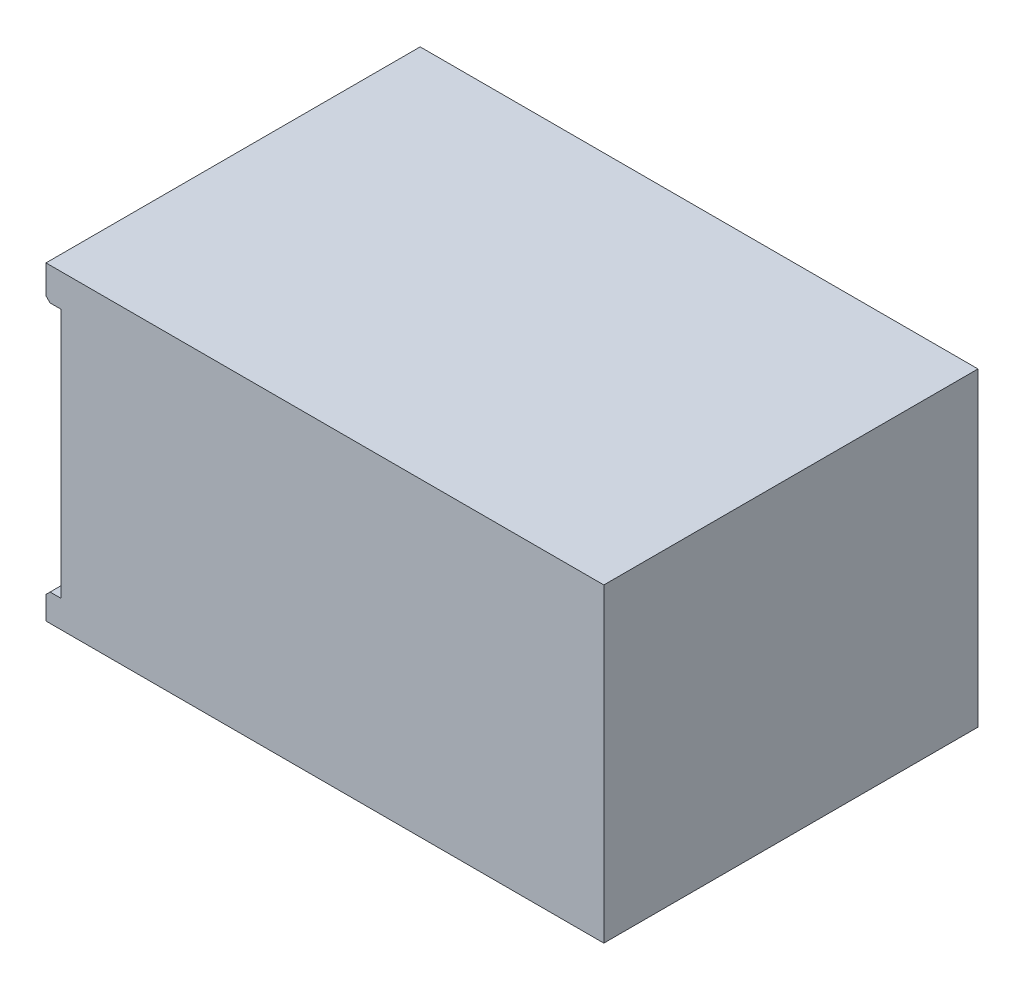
ISO-10303-21;
HEADER;
FILE_DESCRIPTION(('STEP AP214'),'2;1');
FILE_NAME('part.step','',(''),(''),'','','');
FILE_SCHEMA(('AUTOMOTIVE_DESIGN { 1 0 10303 214 1 1 1 1 }'));
ENDSEC;
DATA;
#1=APPLICATION_CONTEXT('core data for automotive mechanical design processes');
#2=APPLICATION_PROTOCOL_DEFINITION('international standard','automotive_design',2000,#1);
#3=PRODUCT_CONTEXT('',#1,'mechanical');
#4=PRODUCT('Part','Part','',(#3));
#5=PRODUCT_RELATED_PRODUCT_CATEGORY('part','',(#4));
#6=PRODUCT_DEFINITION_FORMATION('','',#4);
#7=PRODUCT_DEFINITION_CONTEXT('part definition',#1,'design');
#8=PRODUCT_DEFINITION('design','',#6,#7);
#9=PRODUCT_DEFINITION_SHAPE('','',#8);
#10=(LENGTH_UNIT() NAMED_UNIT(*) SI_UNIT(.MILLI.,.METRE.));
#11=(NAMED_UNIT(*) PLANE_ANGLE_UNIT() SI_UNIT($,.RADIAN.));
#12=(NAMED_UNIT(*) SI_UNIT($,.STERADIAN.) SOLID_ANGLE_UNIT());
#13=UNCERTAINTY_MEASURE_WITH_UNIT(LENGTH_MEASURE(1.E-05),#10,'distance_accuracy_value','');
#14=(GEOMETRIC_REPRESENTATION_CONTEXT(3) GLOBAL_UNCERTAINTY_ASSIGNED_CONTEXT((#13)) GLOBAL_UNIT_ASSIGNED_CONTEXT((#10,
#11,#12)) REPRESENTATION_CONTEXT('',''));
#15=CARTESIAN_POINT('',(0.,0.,0.));
#16=DIRECTION('',(0.,0.,1.));
#17=DIRECTION('',(1.,0.,0.));
#18=AXIS2_PLACEMENT_3D('',#15,#16,#17);
#19=CARTESIAN_POINT('',(-1.397,0.,17.4625));
#20=DIRECTION('',(0.,-1.,0.));
#21=DIRECTION('',(0.,0.,-1.));
#22=AXIS2_PLACEMENT_3D('',#19,#20,#21);
#23=PLANE('',#22);
#24=DIRECTION('',(-1.,0.,0.));
#25=VECTOR('',#24,1.);
#26=CARTESIAN_POINT('',(-1.397,0.,-17.4625));
#27=LINE('',#26,#25);
#28=CARTESIAN_POINT('',(50.673,0.,-17.4625));
#29=VERTEX_POINT('',#28);
#30=CARTESIAN_POINT('',(-1.397,0.,-17.4625));
#31=VERTEX_POINT('',#30);
#32=EDGE_CURVE('E150',#29,#31,#27,.T.);
#33=ORIENTED_EDGE('',*,*,#32,.T.);
#34=DIRECTION('',(0.,0.,-1.));
#35=VECTOR('',#34,1.);
#36=CARTESIAN_POINT('',(-1.397,0.,17.4625));
#37=LINE('',#36,#35);
#38=CARTESIAN_POINT('',(-1.397,0.,17.4625));
#39=VERTEX_POINT('',#38);
#40=EDGE_CURVE('E201',#39,#31,#37,.T.);
#41=ORIENTED_EDGE('',*,*,#40,.F.);
#42=DIRECTION('',(-1.,0.,0.));
#43=VECTOR('',#42,1.);
#44=CARTESIAN_POINT('',(-1.397,0.,17.4625));
#45=LINE('',#44,#43);
#46=CARTESIAN_POINT('',(50.673,0.,17.4625));
#47=VERTEX_POINT('',#46);
#48=EDGE_CURVE('E151',#47,#39,#45,.T.);
#49=ORIENTED_EDGE('',*,*,#48,.F.);
#50=DIRECTION('',(0.,0.,-1.));
#51=VECTOR('',#50,1.);
#52=CARTESIAN_POINT('',(50.673,0.,17.4625));
#53=LINE('',#52,#51);
#54=EDGE_CURVE('E170',#47,#29,#53,.T.);
#55=ORIENTED_EDGE('',*,*,#54,.T.);
#56=EDGE_LOOP('',(#33,#41,#49,#55));
#57=FACE_BOUND('',#56,.T.);
#58=ADVANCED_FACE('F37',(#57),#23,.F.);
#59=CARTESIAN_POINT('',(-1.397,-3.048,17.4625));
#60=DIRECTION('',(1.,0.,0.));
#61=DIRECTION('',(0.,0.,-1.));
#62=AXIS2_PLACEMENT_3D('',#59,#60,#61);
#63=PLANE('',#62);
#64=DIRECTION('',(0.,-1.,0.));
#65=VECTOR('',#64,1.);
#66=CARTESIAN_POINT('',(-1.397,-3.048,-17.4625));
#67=LINE('',#66,#65);
#68=CARTESIAN_POINT('',(-1.397,-2.667,-17.4625));
#69=VERTEX_POINT('',#68);
#70=EDGE_CURVE('E173',#31,#69,#67,.T.);
#71=ORIENTED_EDGE('',*,*,#70,.T.);
#72=DIRECTION('',(0.,0.,1.));
#73=VECTOR('',#72,1.);
#74=CARTESIAN_POINT('',(-1.397,-2.667,17.4625));
#75=LINE('',#74,#73);
#76=CARTESIAN_POINT('',(-1.397,-2.667,17.4625));
#77=VERTEX_POINT('',#76);
#78=EDGE_CURVE('E11',#69,#77,#75,.T.);
#79=ORIENTED_EDGE('',*,*,#78,.T.);
#80=DIRECTION('',(0.,-1.,0.));
#81=VECTOR('',#80,1.);
#82=CARTESIAN_POINT('',(-1.397,-3.048,17.4625));
#83=LINE('',#82,#81);
#84=EDGE_CURVE('E154',#39,#77,#83,.T.);
#85=ORIENTED_EDGE('',*,*,#84,.F.);
#86=ORIENTED_EDGE('',*,*,#40,.T.);
#87=EDGE_LOOP('',(#71,#79,#85,#86));
#88=FACE_BOUND('',#87,.T.);
#89=ADVANCED_FACE('F257',(#88),#63,.F.);
#90=CARTESIAN_POINT('',(0.,-3.048,17.4625));
#91=DIRECTION('',(0.,1.,0.));
#92=DIRECTION('',(0.,0.,1.));
#93=AXIS2_PLACEMENT_3D('',#90,#91,#92);
#94=PLANE('',#93);
#95=DIRECTION('',(1.,0.,0.));
#96=VECTOR('',#95,1.);
#97=CARTESIAN_POINT('',(0.,-3.048,17.4625));
#98=LINE('',#97,#96);
#99=CARTESIAN_POINT('',(-1.01600000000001,-3.048,17.4625));
#100=VERTEX_POINT('',#99);
#101=CARTESIAN_POINT('',(0.,-3.048,17.4625));
#102=VERTEX_POINT('',#101);
#103=EDGE_CURVE('E157',#100,#102,#98,.T.);
#104=ORIENTED_EDGE('',*,*,#103,.F.);
#105=DIRECTION('',(0.,0.,-1.));
#106=VECTOR('',#105,1.);
#107=CARTESIAN_POINT('',(-1.01600000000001,-3.048,17.4625));
#108=LINE('',#107,#106);
#109=CARTESIAN_POINT('',(-1.01600000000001,-3.048,-17.4625));
#110=VERTEX_POINT('',#109);
#111=EDGE_CURVE('E45',#100,#110,#108,.T.);
#112=ORIENTED_EDGE('',*,*,#111,.T.);
#113=DIRECTION('',(1.,0.,0.));
#114=VECTOR('',#113,1.);
#115=CARTESIAN_POINT('',(0.,-3.048,-17.4625));
#116=LINE('',#115,#114);
#117=CARTESIAN_POINT('',(0.,-3.048,-17.4625));
#118=VERTEX_POINT('',#117);
#119=EDGE_CURVE('E175',#110,#118,#116,.T.);
#120=ORIENTED_EDGE('',*,*,#119,.T.);
#121=DIRECTION('',(0.,0.,-1.));
#122=VECTOR('',#121,1.);
#123=CARTESIAN_POINT('',(0.,-3.048,17.4625));
#124=LINE('',#123,#122);
#125=EDGE_CURVE('E198',#102,#118,#124,.T.);
#126=ORIENTED_EDGE('',*,*,#125,.F.);
#127=EDGE_LOOP('',(#104,#112,#120,#126));
#128=FACE_BOUND('',#127,.T.);
#129=ADVANCED_FACE('F219',(#128),#94,.F.);
#130=CARTESIAN_POINT('',(0.,-26.416,17.4625));
#131=DIRECTION('',(1.,0.,0.));
#132=DIRECTION('',(0.,0.,-1.));
#133=AXIS2_PLACEMENT_3D('',#130,#131,#132);
#134=PLANE('',#133);
#135=CARTESIAN_POINT('',(0.,-22.86,-13.97));
#136=DIRECTION('',(-1.,0.,0.));
#137=DIRECTION('',(0.,0.,1.));
#138=AXIS2_PLACEMENT_3D('',#135,#136,#137);
#139=CIRCLE('',#138,1.7526);
#140=CARTESIAN_POINT('',(0.,-22.86,-12.2174));
#141=VERTEX_POINT('',#140);
#142=EDGE_CURVE('E135',#141,#141,#139,.T.);
#143=ORIENTED_EDGE('',*,*,#142,.F.);
#144=EDGE_LOOP('',(#143));
#145=FACE_BOUND('',#144,.T.);
#146=CARTESIAN_POINT('',(0.,-6.096,13.97));
#147=DIRECTION('',(-1.,0.,0.));
#148=DIRECTION('',(0.,0.,1.));
#149=AXIS2_PLACEMENT_3D('',#146,#147,#148);
#150=CIRCLE('',#149,1.7526);
#151=CARTESIAN_POINT('',(0.,-6.096,15.7226));
#152=VERTEX_POINT('',#151);
#153=EDGE_CURVE('E147',#152,#152,#150,.T.);
#154=ORIENTED_EDGE('',*,*,#153,.F.);
#155=EDGE_LOOP('',(#154));
#156=FACE_BOUND('',#155,.T.);
#157=DIRECTION('',(0.,-1.,0.));
#158=VECTOR('',#157,1.);
#159=CARTESIAN_POINT('',(0.,-26.416,-17.4625));
#160=LINE('',#159,#158);
#161=CARTESIAN_POINT('',(0.,-26.416,-17.4625));
#162=VERTEX_POINT('',#161);
#163=EDGE_CURVE('E177',#118,#162,#160,.T.);
#164=ORIENTED_EDGE('',*,*,#163,.T.);
#165=DIRECTION('',(0.,0.,-1.));
#166=VECTOR('',#165,1.);
#167=CARTESIAN_POINT('',(0.,-26.416,17.4625));
#168=LINE('',#167,#166);
#169=CARTESIAN_POINT('',(0.,-26.416,17.4625));
#170=VERTEX_POINT('',#169);
#171=EDGE_CURVE('E195',#170,#162,#168,.T.);
#172=ORIENTED_EDGE('',*,*,#171,.F.);
#173=DIRECTION('',(0.,-1.,0.));
#174=VECTOR('',#173,1.);
#175=CARTESIAN_POINT('',(0.,-26.416,17.4625));
#176=LINE('',#175,#174);
#177=EDGE_CURVE('E159',#102,#170,#176,.T.);
#178=ORIENTED_EDGE('',*,*,#177,.F.);
#179=ORIENTED_EDGE('',*,*,#125,.T.);
#180=EDGE_LOOP('',(#164,#172,#178,#179));
#181=FACE_BOUND('',#180,.T.);
#182=ADVANCED_FACE('F229',(#145,#156,#181),#134,.F.);
#183=CARTESIAN_POINT('',(-1.39700000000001,-26.416,17.4625));
#184=DIRECTION('',(0.,-1.,0.));
#185=DIRECTION('',(0.,0.,-1.));
#186=AXIS2_PLACEMENT_3D('',#183,#184,#185);
#187=PLANE('',#186);
#188=DIRECTION('',(-1.,0.,0.));
#189=VECTOR('',#188,1.);
#190=CARTESIAN_POINT('',(-1.39700000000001,-26.416,-17.4625));
#191=LINE('',#190,#189);
#192=CARTESIAN_POINT('',(-1.01600000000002,-26.416,-17.4625));
#193=VERTEX_POINT('',#192);
#194=EDGE_CURVE('E179',#162,#193,#191,.T.);
#195=ORIENTED_EDGE('',*,*,#194,.T.);
#196=DIRECTION('',(0.,0.,1.));
#197=VECTOR('',#196,1.);
#198=CARTESIAN_POINT('',(-1.01600000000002,-26.416,17.4625));
#199=LINE('',#198,#197);
#200=CARTESIAN_POINT('',(-1.01600000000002,-26.416,17.4625));
#201=VERTEX_POINT('',#200);
#202=EDGE_CURVE('E211',#193,#201,#199,.T.);
#203=ORIENTED_EDGE('',*,*,#202,.T.);
#204=DIRECTION('',(-1.,0.,0.));
#205=VECTOR('',#204,1.);
#206=CARTESIAN_POINT('',(-1.39700000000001,-26.416,17.4625));
#207=LINE('',#206,#205);
#208=EDGE_CURVE('E161',#170,#201,#207,.T.);
#209=ORIENTED_EDGE('',*,*,#208,.F.);
#210=ORIENTED_EDGE('',*,*,#171,.T.);
#211=EDGE_LOOP('',(#195,#203,#209,#210));
#212=FACE_BOUND('',#211,.T.);
#213=ADVANCED_FACE('F233',(#212),#187,.F.);
#214=CARTESIAN_POINT('',(-1.39700000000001,-28.956,17.4625));
#215=DIRECTION('',(1.,0.,0.));
#216=DIRECTION('',(0.,0.,-1.));
#217=AXIS2_PLACEMENT_3D('',#214,#215,#216);
#218=PLANE('',#217);
#219=DIRECTION('',(0.,-1.,0.));
#220=VECTOR('',#219,1.);
#221=CARTESIAN_POINT('',(-1.39700000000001,-28.956,17.4625));
#222=LINE('',#221,#220);
#223=CARTESIAN_POINT('',(-1.39700000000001,-26.797,17.4625));
#224=VERTEX_POINT('',#223);
#225=CARTESIAN_POINT('',(-1.39700000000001,-28.956,17.4625));
#226=VERTEX_POINT('',#225);
#227=EDGE_CURVE('E164',#224,#226,#222,.T.);
#228=ORIENTED_EDGE('',*,*,#227,.F.);
#229=DIRECTION('',(0.,0.,-1.));
#230=VECTOR('',#229,1.);
#231=CARTESIAN_POINT('',(-1.39700000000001,-26.797,17.4625));
#232=LINE('',#231,#230);
#233=CARTESIAN_POINT('',(-1.39700000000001,-26.797,-17.4625));
#234=VERTEX_POINT('',#233);
#235=EDGE_CURVE('E204',#224,#234,#232,.T.);
#236=ORIENTED_EDGE('',*,*,#235,.T.);
#237=DIRECTION('',(0.,-1.,0.));
#238=VECTOR('',#237,1.);
#239=CARTESIAN_POINT('',(-1.39700000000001,-28.956,-17.4625));
#240=LINE('',#239,#238);
#241=CARTESIAN_POINT('',(-1.39700000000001,-28.956,-17.4625));
#242=VERTEX_POINT('',#241);
#243=EDGE_CURVE('E182',#234,#242,#240,.T.);
#244=ORIENTED_EDGE('',*,*,#243,.T.);
#245=DIRECTION('',(0.,0.,-1.));
#246=VECTOR('',#245,1.);
#247=CARTESIAN_POINT('',(-1.39700000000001,-28.956,17.4625));
#248=LINE('',#247,#246);
#249=EDGE_CURVE('E192',#226,#242,#248,.T.);
#250=ORIENTED_EDGE('',*,*,#249,.F.);
#251=EDGE_LOOP('',(#228,#236,#244,#250));
#252=FACE_BOUND('',#251,.T.);
#253=ADVANCED_FACE('F241',(#252),#218,.F.);
#254=CARTESIAN_POINT('',(50.673,-28.956,17.4625));
#255=DIRECTION('',(0.,1.,0.));
#256=DIRECTION('',(-1.,0.,0.));
#257=AXIS2_PLACEMENT_3D('',#254,#255,#256);
#258=PLANE('',#257);
#259=DIRECTION('',(1.,0.,0.));
#260=VECTOR('',#259,1.);
#261=CARTESIAN_POINT('',(50.673,-28.956,-17.4625));
#262=LINE('',#261,#260);
#263=CARTESIAN_POINT('',(50.673,-28.956,-17.4625));
#264=VERTEX_POINT('',#263);
#265=EDGE_CURVE('E184',#242,#264,#262,.T.);
#266=ORIENTED_EDGE('',*,*,#265,.T.);
#267=DIRECTION('',(0.,0.,-1.));
#268=VECTOR('',#267,1.);
#269=CARTESIAN_POINT('',(50.673,-28.956,17.4625));
#270=LINE('',#269,#268);
#271=CARTESIAN_POINT('',(50.673,-28.956,17.4625));
#272=VERTEX_POINT('',#271);
#273=EDGE_CURVE('E189',#272,#264,#270,.T.);
#274=ORIENTED_EDGE('',*,*,#273,.F.);
#275=DIRECTION('',(1.,0.,0.));
#276=VECTOR('',#275,1.);
#277=CARTESIAN_POINT('',(50.673,-28.956,17.4625));
#278=LINE('',#277,#276);
#279=EDGE_CURVE('E166',#226,#272,#278,.T.);
#280=ORIENTED_EDGE('',*,*,#279,.F.);
#281=ORIENTED_EDGE('',*,*,#249,.T.);
#282=EDGE_LOOP('',(#266,#274,#280,#281));
#283=FACE_BOUND('',#282,.T.);
#284=ADVANCED_FACE('F248',(#283),#258,.F.);
#285=CARTESIAN_POINT('',(50.673,0.,17.4625));
#286=DIRECTION('',(-1.,0.,0.));
#287=DIRECTION('',(0.,-1.,0.));
#288=AXIS2_PLACEMENT_3D('',#285,#286,#287);
#289=PLANE('',#288);
#290=DIRECTION('',(0.,1.,0.));
#291=VECTOR('',#290,1.);
#292=CARTESIAN_POINT('',(50.673,0.,-17.4625));
#293=LINE('',#292,#291);
#294=EDGE_CURVE('E155',#264,#29,#293,.T.);
#295=ORIENTED_EDGE('',*,*,#294,.T.);
#296=ORIENTED_EDGE('',*,*,#54,.F.);
#297=DIRECTION('',(0.,1.,0.));
#298=VECTOR('',#297,1.);
#299=CARTESIAN_POINT('',(50.673,0.,17.4625));
#300=LINE('',#299,#298);
#301=EDGE_CURVE('E168',#272,#47,#300,.T.);
#302=ORIENTED_EDGE('',*,*,#301,.F.);
#303=ORIENTED_EDGE('',*,*,#273,.T.);
#304=EDGE_LOOP('',(#295,#296,#302,#303));
#305=FACE_BOUND('',#304,.T.);
#306=ADVANCED_FACE('F252',(#305),#289,.F.);
#307=CARTESIAN_POINT('',(-1.39700000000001,0.,17.4625));
#308=DIRECTION('',(0.,0.,1.));
#309=DIRECTION('',(1.,0.,0.));
#310=AXIS2_PLACEMENT_3D('',#307,#308,#309);
#311=PLANE('',#310);
#312=ORIENTED_EDGE('',*,*,#208,.T.);
#313=DIRECTION('',(0.707106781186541,0.707106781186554,0.));
#314=VECTOR('',#313,1.);
#315=CARTESIAN_POINT('',(12.0015,-13.3984999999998,17.4625));
#316=LINE('',#315,#314);
#317=EDGE_CURVE('E214',#201,#224,#316,.F.);
#318=ORIENTED_EDGE('',*,*,#317,.T.);
#319=ORIENTED_EDGE('',*,*,#227,.T.);
#320=ORIENTED_EDGE('',*,*,#279,.T.);
#321=ORIENTED_EDGE('',*,*,#301,.T.);
#322=ORIENTED_EDGE('',*,*,#48,.T.);
#323=ORIENTED_EDGE('',*,*,#84,.T.);
#324=DIRECTION('',(-0.707106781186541,0.707106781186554,0.));
#325=VECTOR('',#324,1.);
#326=CARTESIAN_POINT('',(-2.73050000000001,-1.33349999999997,17.4625));
#327=LINE('',#326,#325);
#328=EDGE_CURVE('E52',#77,#100,#327,.F.);
#329=ORIENTED_EDGE('',*,*,#328,.T.);
#330=ORIENTED_EDGE('',*,*,#103,.T.);
#331=ORIENTED_EDGE('',*,*,#177,.T.);
#332=EDGE_LOOP('',(#312,#318,#319,#320,#321,#322,#323,#329,#330,#331));
#333=FACE_BOUND('',#332,.T.);
#334=ADVANCED_FACE('F236',(#333),#311,.T.);
#335=CARTESIAN_POINT('',(-1.39700000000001,0.,-17.4625));
#336=DIRECTION('',(0.,0.,1.));
#337=DIRECTION('',(1.,0.,0.));
#338=AXIS2_PLACEMENT_3D('',#335,#336,#337);
#339=PLANE('',#338);
#340=ORIENTED_EDGE('',*,*,#243,.F.);
#341=DIRECTION('',(-0.707106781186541,-0.707106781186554,0.));
#342=VECTOR('',#341,1.);
#343=CARTESIAN_POINT('',(-1.39700000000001,-26.797,-17.4625));
#344=LINE('',#343,#342);
#345=EDGE_CURVE('E209',#234,#193,#344,.F.);
#346=ORIENTED_EDGE('',*,*,#345,.T.);
#347=ORIENTED_EDGE('',*,*,#194,.F.);
#348=ORIENTED_EDGE('',*,*,#163,.F.);
#349=ORIENTED_EDGE('',*,*,#119,.F.);
#350=DIRECTION('',(0.707106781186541,-0.707106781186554,0.));
#351=VECTOR('',#350,1.);
#352=CARTESIAN_POINT('',(-1.01600000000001,-3.048,-17.4625));
#353=LINE('',#352,#351);
#354=EDGE_CURVE('E207',#110,#69,#353,.F.);
#355=ORIENTED_EDGE('',*,*,#354,.T.);
#356=ORIENTED_EDGE('',*,*,#70,.F.);
#357=ORIENTED_EDGE('',*,*,#32,.F.);
#358=ORIENTED_EDGE('',*,*,#294,.F.);
#359=ORIENTED_EDGE('',*,*,#265,.F.);
#360=EDGE_LOOP('',(#340,#346,#347,#348,#349,#355,#356,#357,#358,#359));
#361=FACE_BOUND('',#360,.T.);
#362=ADVANCED_FACE('F225',(#361),#339,.F.);
#363=CARTESIAN_POINT('',(0.,-6.096,13.97));
#364=DIRECTION('',(-1.,0.,0.));
#365=DIRECTION('',(0.,0.,1.));
#366=AXIS2_PLACEMENT_3D('',#363,#364,#365);
#367=CYLINDRICAL_SURFACE('',#366,1.7526);
#368=CARTESIAN_POINT('',(7.62,-6.096,13.97));
#369=DIRECTION('',(-1.,0.,0.));
#370=DIRECTION('',(0.,0.,1.));
#371=AXIS2_PLACEMENT_3D('',#368,#369,#370);
#372=CIRCLE('',#371,1.7526);
#373=CARTESIAN_POINT('',(7.62,-6.096,15.7226));
#374=VERTEX_POINT('',#373);
#375=EDGE_CURVE('E144',#374,#374,#372,.T.);
#376=ORIENTED_EDGE('',*,*,#375,.F.);
#377=EDGE_LOOP('',(#376));
#378=FACE_BOUND('',#377,.T.);
#379=ORIENTED_EDGE('',*,*,#153,.T.);
#380=EDGE_LOOP('',(#379));
#381=FACE_BOUND('',#380,.T.);
#382=ADVANCED_FACE('F284',(#378,#381),#367,.F.);
#383=CARTESIAN_POINT('',(7.62,-4.74345,13.97));
#384=DIRECTION('',(1.,0.,0.));
#385=DIRECTION('',(0.,0.,-1.));
#386=AXIS2_PLACEMENT_3D('',#383,#384,#385);
#387=PLANE('',#386);
#388=CARTESIAN_POINT('',(7.62,-6.096,13.97));
#389=DIRECTION('',(-1.,0.,0.));
#390=DIRECTION('',(0.,0.,1.));
#391=AXIS2_PLACEMENT_3D('',#388,#389,#390);
#392=CIRCLE('',#391,1.35255);
#393=CARTESIAN_POINT('',(7.62,-6.096,15.32255));
#394=VERTEX_POINT('',#393);
#395=EDGE_CURVE('E141',#394,#394,#392,.T.);
#396=ORIENTED_EDGE('',*,*,#395,.F.);
#397=EDGE_LOOP('',(#396));
#398=FACE_BOUND('',#397,.T.);
#399=ORIENTED_EDGE('',*,*,#375,.T.);
#400=EDGE_LOOP('',(#399));
#401=FACE_BOUND('',#400,.T.);
#402=ADVANCED_FACE('F289',(#398,#401),#387,.F.);
#403=CARTESIAN_POINT('',(0.,-6.096,13.97));
#404=DIRECTION('',(-1.,0.,0.));
#405=DIRECTION('',(0.,0.,1.));
#406=AXIS2_PLACEMENT_3D('',#403,#404,#405);
#407=CYLINDRICAL_SURFACE('',#406,1.35255);
#408=CARTESIAN_POINT('',(9.99744,-6.096,13.97));
#409=DIRECTION('',(-1.,0.,0.));
#410=DIRECTION('',(0.,0.,1.));
#411=AXIS2_PLACEMENT_3D('',#408,#409,#410);
#412=CIRCLE('',#411,1.35255);
#413=CARTESIAN_POINT('',(9.99744,-6.096,15.32255));
#414=VERTEX_POINT('',#413);
#415=EDGE_CURVE('E138',#414,#414,#412,.T.);
#416=ORIENTED_EDGE('',*,*,#415,.F.);
#417=EDGE_LOOP('',(#416));
#418=FACE_BOUND('',#417,.T.);
#419=ORIENTED_EDGE('',*,*,#395,.T.);
#420=EDGE_LOOP('',(#419));
#421=FACE_BOUND('',#420,.T.);
#422=ADVANCED_FACE('F293',(#418,#421),#407,.F.);
#423=CARTESIAN_POINT('',(9.99744,-6.096,13.97));
#424=DIRECTION('',(-1.,0.,0.));
#425=DIRECTION('',(0.,0.,1.));
#426=AXIS2_PLACEMENT_3D('',#423,#424,#425);
#427=CONICAL_SURFACE('',#426,1.35255,1.02974425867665);
#428=CARTESIAN_POINT('',(10.8101340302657,-6.096,13.97));
#429=VERTEX_POINT('',#428);
#430=VERTEX_LOOP('',#429);
#431=FACE_BOUND('',#430,.T.);
#432=ORIENTED_EDGE('',*,*,#415,.T.);
#433=EDGE_LOOP('',(#432));
#434=FACE_BOUND('',#433,.T.);
#435=ADVANCED_FACE('F297',(#431,#434),#427,.F.);
#436=CARTESIAN_POINT('',(0.,-22.86,-13.97));
#437=DIRECTION('',(-1.,0.,0.));
#438=DIRECTION('',(0.,0.,1.));
#439=AXIS2_PLACEMENT_3D('',#436,#437,#438);
#440=CYLINDRICAL_SURFACE('',#439,1.7526);
#441=CARTESIAN_POINT('',(7.62,-22.86,-13.97));
#442=DIRECTION('',(-1.,0.,0.));
#443=DIRECTION('',(0.,0.,1.));
#444=AXIS2_PLACEMENT_3D('',#441,#442,#443);
#445=CIRCLE('',#444,1.7526);
#446=CARTESIAN_POINT('',(7.62,-22.86,-12.2174));
#447=VERTEX_POINT('',#446);
#448=EDGE_CURVE('E130',#447,#447,#445,.T.);
#449=ORIENTED_EDGE('',*,*,#448,.F.);
#450=EDGE_LOOP('',(#449));
#451=FACE_BOUND('',#450,.T.);
#452=ORIENTED_EDGE('',*,*,#142,.T.);
#453=EDGE_LOOP('',(#452));
#454=FACE_BOUND('',#453,.T.);
#455=ADVANCED_FACE('F301',(#451,#454),#440,.F.);
#456=CARTESIAN_POINT('',(7.62,-21.50745,-13.97));
#457=DIRECTION('',(1.,0.,0.));
#458=DIRECTION('',(0.,0.,-1.));
#459=AXIS2_PLACEMENT_3D('',#456,#457,#458);
#460=PLANE('',#459);
#461=CARTESIAN_POINT('',(7.62,-22.86,-13.97));
#462=DIRECTION('',(-1.,0.,0.));
#463=DIRECTION('',(0.,0.,1.));
#464=AXIS2_PLACEMENT_3D('',#461,#462,#463);
#465=CIRCLE('',#464,1.35255);
#466=CARTESIAN_POINT('',(7.62,-22.86,-12.61745));
#467=VERTEX_POINT('',#466);
#468=EDGE_CURVE('E127',#467,#467,#465,.T.);
#469=ORIENTED_EDGE('',*,*,#468,.F.);
#470=EDGE_LOOP('',(#469));
#471=FACE_BOUND('',#470,.T.);
#472=ORIENTED_EDGE('',*,*,#448,.T.);
#473=EDGE_LOOP('',(#472));
#474=FACE_BOUND('',#473,.T.);
#475=ADVANCED_FACE('F305',(#471,#474),#460,.F.);
#476=CARTESIAN_POINT('',(0.,-22.86,-13.97));
#477=DIRECTION('',(-1.,0.,0.));
#478=DIRECTION('',(0.,0.,1.));
#479=AXIS2_PLACEMENT_3D('',#476,#477,#478);
#480=CYLINDRICAL_SURFACE('',#479,1.35255);
#481=CARTESIAN_POINT('',(9.99744,-22.86,-13.97));
#482=DIRECTION('',(-1.,0.,0.));
#483=DIRECTION('',(0.,0.,1.));
#484=AXIS2_PLACEMENT_3D('',#481,#482,#483);
#485=CIRCLE('',#484,1.35255);
#486=CARTESIAN_POINT('',(9.99744,-22.86,-12.61745));
#487=VERTEX_POINT('',#486);
#488=EDGE_CURVE('E125',#487,#487,#485,.T.);
#489=ORIENTED_EDGE('',*,*,#488,.F.);
#490=EDGE_LOOP('',(#489));
#491=FACE_BOUND('',#490,.T.);
#492=ORIENTED_EDGE('',*,*,#468,.T.);
#493=EDGE_LOOP('',(#492));
#494=FACE_BOUND('',#493,.T.);
#495=ADVANCED_FACE('F121',(#491,#494),#480,.F.);
#496=CARTESIAN_POINT('',(9.99744,-22.86,-13.97));
#497=DIRECTION('',(-1.,0.,0.));
#498=DIRECTION('',(0.,0.,1.));
#499=AXIS2_PLACEMENT_3D('',#496,#497,#498);
#500=CONICAL_SURFACE('',#499,1.35255,1.02974425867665);
#501=CARTESIAN_POINT('',(10.8101340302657,-22.86,-13.97));
#502=VERTEX_POINT('',#501);
#503=VERTEX_LOOP('',#502);
#504=FACE_BOUND('',#503,.T.);
#505=ORIENTED_EDGE('',*,*,#488,.T.);
#506=EDGE_LOOP('',(#505));
#507=FACE_BOUND('',#506,.T.);
#508=ADVANCED_FACE('F117',(#504,#507),#500,.F.);
#509=CARTESIAN_POINT('',(-1.39700000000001,-26.797,17.4625));
#510=DIRECTION('',(0.707106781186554,-0.707106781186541,0.));
#511=DIRECTION('',(0.707106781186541,0.707106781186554,0.));
#512=AXIS2_PLACEMENT_3D('',#509,#510,#511);
#513=PLANE('',#512);
#514=ORIENTED_EDGE('',*,*,#317,.F.);
#515=ORIENTED_EDGE('',*,*,#202,.F.);
#516=ORIENTED_EDGE('',*,*,#345,.F.);
#517=ORIENTED_EDGE('',*,*,#235,.F.);
#518=EDGE_LOOP('',(#514,#515,#516,#517));
#519=FACE_BOUND('',#518,.T.);
#520=ADVANCED_FACE('F120',(#519),#513,.F.);
#521=CARTESIAN_POINT('',(-1.01600000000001,-3.048,17.4625));
#522=DIRECTION('',(0.707106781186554,0.707106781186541,0.));
#523=DIRECTION('',(-0.707106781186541,0.707106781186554,0.));
#524=AXIS2_PLACEMENT_3D('',#521,#522,#523);
#525=PLANE('',#524);
#526=ORIENTED_EDGE('',*,*,#328,.F.);
#527=ORIENTED_EDGE('',*,*,#78,.F.);
#528=ORIENTED_EDGE('',*,*,#354,.F.);
#529=ORIENTED_EDGE('',*,*,#111,.F.);
#530=EDGE_LOOP('',(#526,#527,#528,#529));
#531=FACE_BOUND('',#530,.T.);
#532=ADVANCED_FACE('F39',(#531),#525,.F.);
#533=CLOSED_SHELL('',(#58,#89,#129,#182,#213,#253,#284,#306,#334,#362,#382,#402,#422,#435,#455,
#475,#495,#508,#520,#532));
#534=MANIFOLD_SOLID_BREP('B2',#533);
#535=ADVANCED_BREP_SHAPE_REPRESENTATION('',(#18,#534),#14);
#536=SHAPE_DEFINITION_REPRESENTATION(#9,#535);
ENDSEC;
END-ISO-10303-21;
